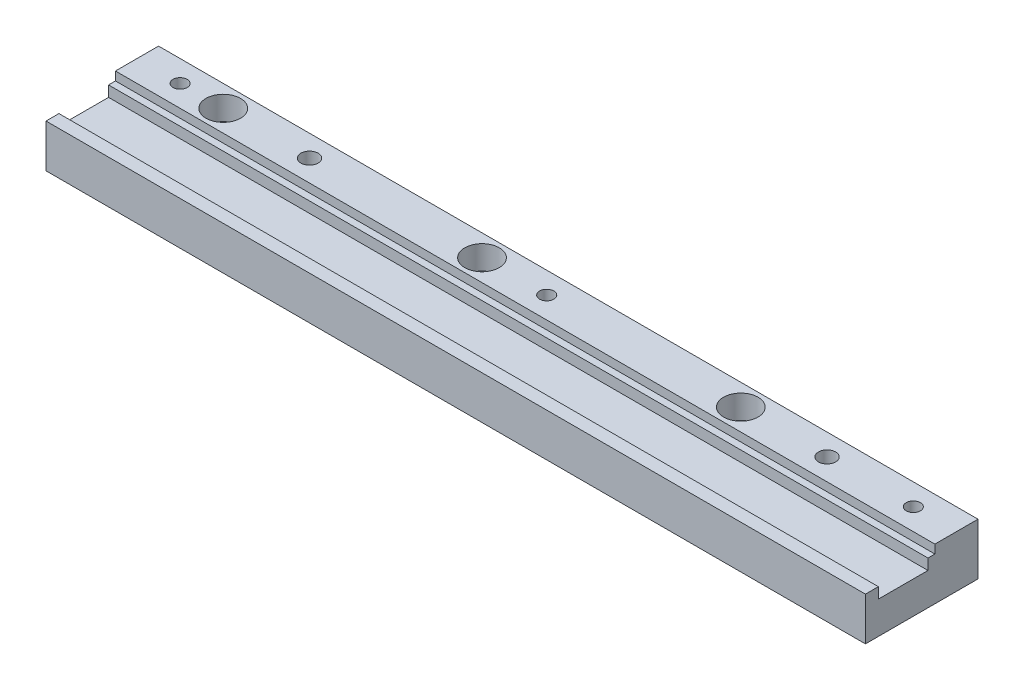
from build123d import *

# Parameters (mm, degrees)
SKETCH_1_W          = 190
SKETCH_1_H          = 12
EXTRUDE_1_DEPTH     = 26.1
SKETCH_2_OUTSIDE_W  = 66.532
SKETCH_2_OUTSIDE_H  = 52.432
CUT_EXTRUDE_1_DEPTH = 193.159334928
SKETCH_3_R          = 2.25
SKETCH_3_R_2        = 1.65
SKETCH_3_R_3        = 2
CUT_EXTRUDE_2_DEPTH = 26.1
SKETCH_4_R          = 4
CUT_EXTRUDE_3_DEPTH = 5.5


with BuildPart() as part:
    # Sketch 1 → Extrude 1 (new body)
    with BuildSketch(Plane.XY):
        with Locations((95, 6)):
            Rectangle(SKETCH_1_W, SKETCH_1_H)
    extrude(amount=EXTRUDE_1_DEPTH)

    # Sketch 2 outside → Cut-Extrude 1 (cut, through all)
    with BuildSketch(Plane(origin=(190, 0, 0), x_dir=(0, 0, -1), z_dir=(1, 0, 0))):
        with Locations((-13.05, 6)):
            Rectangle(SKETCH_2_OUTSIDE_W, SKETCH_2_OUTSIDE_H)
        Polygon((-23.1, 7.5), (-11.6, 7.5), (-11.6, 10), (-10, 10), (-10, 12), (0, 12), (0, 0), (-26.1, 0), (-26.1, 10), (-23.1, 10), align=None, mode=Mode.SUBTRACT)
    extrude(amount=-CUT_EXTRUDE_1_DEPTH, mode=Mode.SUBTRACT)

    # Sketch 3 → Cut-Extrude 2 (cut)
    with BuildSketch(Plane(origin=(0, 12, 0), x_dir=(1, 0, 0), z_dir=(0, 1, 0))):
        with Locations(Location((140, -5, 0), (0, 0, 270))):
            Circle(SKETCH_3_R)
        with Locations(Location((20, -5, 0), (0, 0, 270))):
            Circle(SKETCH_3_R)
        with Locations(Location((80, -5, 0), (0, 0, 270))):
            Circle(SKETCH_3_R)
        with Locations(Location((10, -5, 0), (0, 0, 270))):
            Circle(SKETCH_3_R_2)
        with Locations(Location((95, -5, 0), (0, 0, 270))):
            Circle(SKETCH_3_R_2)
        with Locations(Location((180, -5, 0), (0, 0, 270))):
            Circle(SKETCH_3_R_2)
        with Locations(Location((160, -5, 0), (0, 0, 270))):
            Circle(SKETCH_3_R_3)
        with Locations(Location((40, -5, 0), (0, 0, 270))):
            Circle(SKETCH_3_R_3)
    extrude(amount=-CUT_EXTRUDE_2_DEPTH, mode=Mode.SUBTRACT)

    # Sketch 4 → Cut-Extrude 3 (cut)
    with BuildSketch(Plane(origin=(0, 12, 0), x_dir=(1, 0, 0), z_dir=(0, 1, 0))):
        with Locations(Location((140, -5, 0), (0, 0, 270))):
            Circle(SKETCH_4_R)
        with Locations(Location((20, -5, 0), (0, 0, 270))):
            Circle(SKETCH_4_R)
        with Locations(Location((80, -5, 0), (0, 0, 270))):
            Circle(SKETCH_4_R)
    extrude(amount=-CUT_EXTRUDE_3_DEPTH, mode=Mode.SUBTRACT)


solid = part.part
